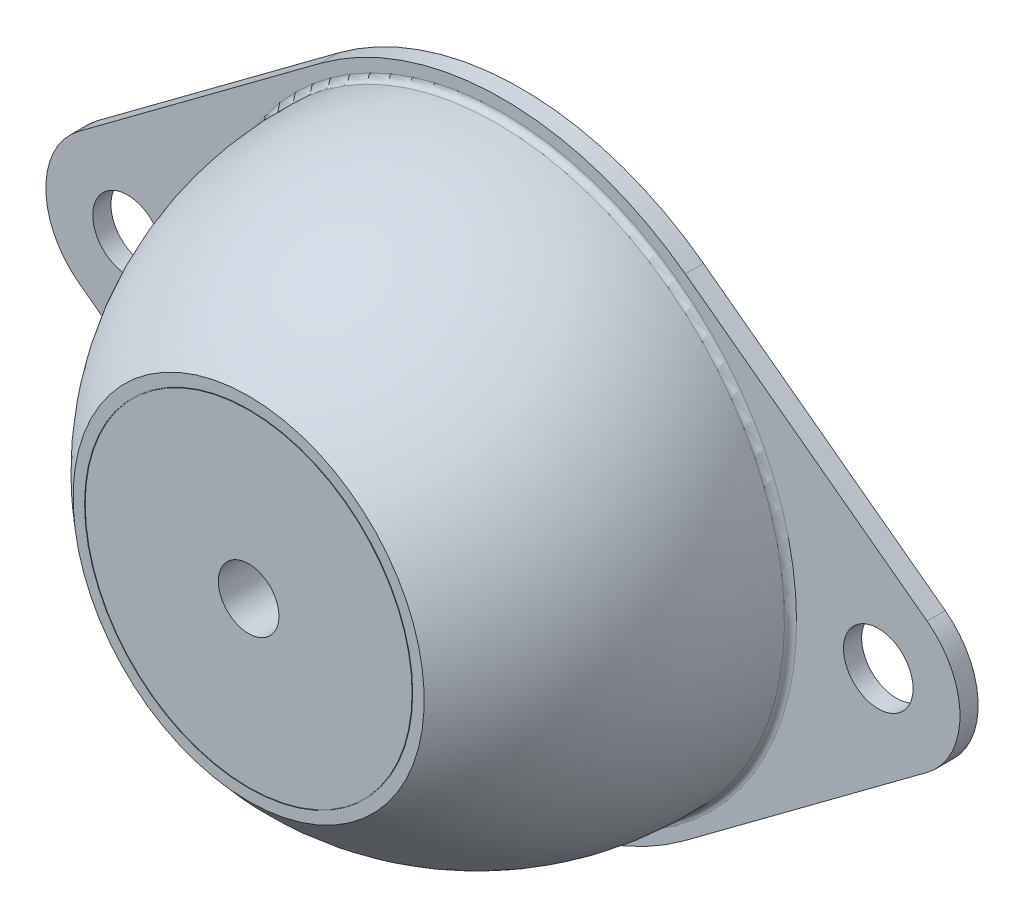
ISO-10303-21;
HEADER;
FILE_DESCRIPTION(('STEP AP214'),'2;1');
FILE_NAME('part.step','',(''),(''),'','','');
FILE_SCHEMA(('AUTOMOTIVE_DESIGN { 1 0 10303 214 1 1 1 1 }'));
ENDSEC;
DATA;
#1=APPLICATION_CONTEXT('core data for automotive mechanical design processes');
#2=APPLICATION_PROTOCOL_DEFINITION('international standard','automotive_design',2000,#1);
#3=PRODUCT_CONTEXT('',#1,'mechanical');
#4=PRODUCT('Part','Part','',(#3));
#5=PRODUCT_RELATED_PRODUCT_CATEGORY('part','',(#4));
#6=PRODUCT_DEFINITION_FORMATION('','',#4);
#7=PRODUCT_DEFINITION_CONTEXT('part definition',#1,'design');
#8=PRODUCT_DEFINITION('design','',#6,#7);
#9=PRODUCT_DEFINITION_SHAPE('','',#8);
#10=(LENGTH_UNIT() NAMED_UNIT(*) SI_UNIT(.MILLI.,.METRE.));
#11=(NAMED_UNIT(*) PLANE_ANGLE_UNIT() SI_UNIT($,.RADIAN.));
#12=(NAMED_UNIT(*) SI_UNIT($,.STERADIAN.) SOLID_ANGLE_UNIT());
#13=UNCERTAINTY_MEASURE_WITH_UNIT(LENGTH_MEASURE(1.E-05),#10,'distance_accuracy_value','');
#14=(GEOMETRIC_REPRESENTATION_CONTEXT(3) GLOBAL_UNCERTAINTY_ASSIGNED_CONTEXT((#13)) GLOBAL_UNIT_ASSIGNED_CONTEXT((#10,
#11,#12)) REPRESENTATION_CONTEXT('',''));
#15=CARTESIAN_POINT('',(0.,0.,0.));
#16=DIRECTION('',(0.,0.,1.));
#17=DIRECTION('',(1.,0.,0.));
#18=AXIS2_PLACEMENT_3D('',#15,#16,#17);
#19=CARTESIAN_POINT('',(0.,0.,3.));
#20=DIRECTION('',(0.,0.,1.));
#21=DIRECTION('',(0.,-1.,0.));
#22=AXIS2_PLACEMENT_3D('',#19,#20,#21);
#23=PLANE('',#22);
#24=DIRECTION('',(-0.802409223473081,-0.596774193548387,0.));
#25=VECTOR('',#24,1.);
#26=CARTESIAN_POINT('',(31.8629032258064,40.5216657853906,3.));
#27=LINE('',#26,#25);
#28=CARTESIAN_POINT('',(31.8629032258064,40.5216657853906,3.));
#29=VERTEX_POINT('',#28);
#30=CARTESIAN_POINT('',(-8.05645161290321,10.8325245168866,3.));
#31=VERTEX_POINT('',#30);
#32=EDGE_CURVE('E141',#29,#31,#27,.T.);
#33=ORIENTED_EDGE('',*,*,#32,.T.);
#34=CARTESIAN_POINT('',(0.,0.,3.));
#35=DIRECTION('',(0.,0.,1.));
#36=DIRECTION('',(1.,0.,0.));
#37=AXIS2_PLACEMENT_3D('',#34,#35,#36);
#38=CIRCLE('',#37,13.5);
#39=CARTESIAN_POINT('',(-8.05645161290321,-10.8325245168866,3.));
#40=VERTEX_POINT('',#39);
#41=EDGE_CURVE('E74',#31,#40,#38,.T.);
#42=ORIENTED_EDGE('',*,*,#41,.T.);
#43=DIRECTION('',(0.802409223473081,-0.596774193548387,0.));
#44=VECTOR('',#43,1.);
#45=CARTESIAN_POINT('',(-8.05645161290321,-10.8325245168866,3.));
#46=LINE('',#45,#44);
#47=CARTESIAN_POINT('',(31.8629032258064,-40.5216657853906,3.));
#48=VERTEX_POINT('',#47);
#49=EDGE_CURVE('E156',#40,#48,#46,.T.);
#50=ORIENTED_EDGE('',*,*,#49,.T.);
#51=CARTESIAN_POINT('',(62.,0.,3.));
#52=DIRECTION('',(0.,0.,1.));
#53=DIRECTION('',(1.,0.,0.));
#54=AXIS2_PLACEMENT_3D('',#51,#52,#53);
#55=CIRCLE('',#54,50.5);
#56=CARTESIAN_POINT('',(92.1370967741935,-40.5216657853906,3.));
#57=VERTEX_POINT('',#56);
#58=EDGE_CURVE('E169',#48,#57,#55,.T.);
#59=ORIENTED_EDGE('',*,*,#58,.T.);
#60=DIRECTION('',(0.802409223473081,0.596774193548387,0.));
#61=VECTOR('',#60,1.);
#62=CARTESIAN_POINT('',(92.1370967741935,-40.5216657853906,3.));
#63=LINE('',#62,#61);
#64=CARTESIAN_POINT('',(132.056451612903,-10.8325245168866,3.));
#65=VERTEX_POINT('',#64);
#66=EDGE_CURVE('E93',#57,#65,#63,.T.);
#67=ORIENTED_EDGE('',*,*,#66,.T.);
#68=CARTESIAN_POINT('',(124.,0.,3.));
#69=DIRECTION('',(0.,0.,1.));
#70=DIRECTION('',(1.,0.,0.));
#71=AXIS2_PLACEMENT_3D('',#68,#69,#70);
#72=CIRCLE('',#71,13.5);
#73=CARTESIAN_POINT('',(132.056451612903,10.8325245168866,3.));
#74=VERTEX_POINT('',#73);
#75=EDGE_CURVE('E87',#65,#74,#72,.T.);
#76=ORIENTED_EDGE('',*,*,#75,.T.);
#77=DIRECTION('',(-0.802409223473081,0.596774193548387,0.));
#78=VECTOR('',#77,1.);
#79=CARTESIAN_POINT('',(132.056451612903,10.8325245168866,3.));
#80=LINE('',#79,#78);
#81=CARTESIAN_POINT('',(92.1370967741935,40.5216657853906,3.));
#82=VERTEX_POINT('',#81);
#83=EDGE_CURVE('E91',#74,#82,#80,.T.);
#84=ORIENTED_EDGE('',*,*,#83,.T.);
#85=CARTESIAN_POINT('',(62.,0.,3.));
#86=DIRECTION('',(0.,0.,1.));
#87=DIRECTION('',(1.,0.,0.));
#88=AXIS2_PLACEMENT_3D('',#85,#86,#87);
#89=CIRCLE('',#88,50.5);
#90=EDGE_CURVE('E31',#82,#29,#89,.T.);
#91=ORIENTED_EDGE('',*,*,#90,.T.);
#92=EDGE_LOOP('',(#33,#42,#50,#59,#67,#76,#84,#91));
#93=FACE_BOUND('',#92,.T.);
#94=CARTESIAN_POINT('',(124.,0.,3.));
#95=DIRECTION('',(0.,0.,1.));
#96=DIRECTION('',(1.,0.,0.));
#97=AXIS2_PLACEMENT_3D('',#94,#95,#96);
#98=CIRCLE('',#97,5.75);
#99=CARTESIAN_POINT('',(129.75,0.,3.));
#100=VERTEX_POINT('',#99);
#101=EDGE_CURVE('E107',#100,#100,#98,.T.);
#102=ORIENTED_EDGE('',*,*,#101,.F.);
#103=EDGE_LOOP('',(#102));
#104=FACE_BOUND('',#103,.T.);
#105=CARTESIAN_POINT('',(0.,0.,3.));
#106=DIRECTION('',(0.,0.,1.));
#107=DIRECTION('',(1.,0.,0.));
#108=AXIS2_PLACEMENT_3D('',#105,#106,#107);
#109=CIRCLE('',#108,5.75);
#110=CARTESIAN_POINT('',(5.75,0.,3.));
#111=VERTEX_POINT('',#110);
#112=EDGE_CURVE('E113',#111,#111,#109,.T.);
#113=ORIENTED_EDGE('',*,*,#112,.F.);
#114=EDGE_LOOP('',(#113));
#115=FACE_BOUND('',#114,.T.);
#116=CARTESIAN_POINT('',(62.,0.,3.));
#117=DIRECTION('',(0.,0.,-1.));
#118=DIRECTION('',(0.,1.,0.));
#119=AXIS2_PLACEMENT_3D('',#116,#117,#118);
#120=CIRCLE('',#119,48.5);
#121=CARTESIAN_POINT('',(62.,48.5,3.));
#122=VERTEX_POINT('',#121);
#123=EDGE_CURVE('E192',#122,#122,#120,.T.);
#124=ORIENTED_EDGE('',*,*,#123,.T.);
#125=EDGE_LOOP('',(#124));
#126=FACE_BOUND('',#125,.T.);
#127=ADVANCED_FACE('F14',(#93,#104,#115,#126),#23,.T.);
#128=CARTESIAN_POINT('',(31.8629032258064,40.5216657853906,3.));
#129=DIRECTION('',(0.596774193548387,-0.802409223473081,0.));
#130=DIRECTION('',(0.802409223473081,0.596774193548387,0.));
#131=AXIS2_PLACEMENT_3D('',#128,#129,#130);
#132=PLANE('',#131);
#133=DIRECTION('',(-0.802409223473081,-0.596774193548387,0.));
#134=VECTOR('',#133,1.);
#135=CARTESIAN_POINT('',(31.8629032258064,40.5216657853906,0.));
#136=LINE('',#135,#134);
#137=CARTESIAN_POINT('',(31.8629032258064,40.5216657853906,0.));
#138=VERTEX_POINT('',#137);
#139=CARTESIAN_POINT('',(-8.05645161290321,10.8325245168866,0.));
#140=VERTEX_POINT('',#139);
#141=EDGE_CURVE('E117',#138,#140,#136,.T.);
#142=ORIENTED_EDGE('',*,*,#141,.T.);
#143=DIRECTION('',(0.,0.,-1.));
#144=VECTOR('',#143,1.);
#145=CARTESIAN_POINT('',(-8.05645161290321,10.8325245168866,3.));
#146=LINE('',#145,#144);
#147=EDGE_CURVE('E9',#31,#140,#146,.T.);
#148=ORIENTED_EDGE('',*,*,#147,.F.);
#149=ORIENTED_EDGE('',*,*,#32,.F.);
#150=DIRECTION('',(0.,0.,-1.));
#151=VECTOR('',#150,1.);
#152=CARTESIAN_POINT('',(31.8629032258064,40.5216657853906,3.));
#153=LINE('',#152,#151);
#154=EDGE_CURVE('E116',#29,#138,#153,.T.);
#155=ORIENTED_EDGE('',*,*,#154,.T.);
#156=EDGE_LOOP('',(#142,#148,#149,#155));
#157=FACE_BOUND('',#156,.T.);
#158=ADVANCED_FACE('F16',(#157),#132,.F.);
#159=CARTESIAN_POINT('',(0.,0.,3.));
#160=DIRECTION('',(0.,0.,-1.));
#161=DIRECTION('',(0.,1.,0.));
#162=AXIS2_PLACEMENT_3D('',#159,#160,#161);
#163=CYLINDRICAL_SURFACE('',#162,13.5);
#164=CARTESIAN_POINT('',(0.,0.,0.));
#165=DIRECTION('',(0.,0.,1.));
#166=DIRECTION('',(1.,0.,0.));
#167=AXIS2_PLACEMENT_3D('',#164,#165,#166);
#168=CIRCLE('',#167,13.5);
#169=CARTESIAN_POINT('',(-8.05645161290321,-10.8325245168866,0.));
#170=VERTEX_POINT('',#169);
#171=EDGE_CURVE('E120',#140,#170,#168,.T.);
#172=ORIENTED_EDGE('',*,*,#171,.T.);
#173=DIRECTION('',(0.,0.,-1.));
#174=VECTOR('',#173,1.);
#175=CARTESIAN_POINT('',(-8.05645161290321,-10.8325245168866,3.));
#176=LINE('',#175,#174);
#177=EDGE_CURVE('E23',#40,#170,#176,.T.);
#178=ORIENTED_EDGE('',*,*,#177,.F.);
#179=ORIENTED_EDGE('',*,*,#41,.F.);
#180=ORIENTED_EDGE('',*,*,#147,.T.);
#181=EDGE_LOOP('',(#172,#178,#179,#180));
#182=FACE_BOUND('',#181,.T.);
#183=ADVANCED_FACE('F236',(#182),#163,.T.);
#184=CARTESIAN_POINT('',(-8.05645161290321,-10.8325245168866,3.));
#185=DIRECTION('',(0.596774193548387,0.802409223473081,0.));
#186=DIRECTION('',(-0.802409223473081,0.596774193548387,0.));
#187=AXIS2_PLACEMENT_3D('',#184,#185,#186);
#188=PLANE('',#187);
#189=DIRECTION('',(0.802409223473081,-0.596774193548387,0.));
#190=VECTOR('',#189,1.);
#191=CARTESIAN_POINT('',(-8.05645161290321,-10.8325245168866,0.));
#192=LINE('',#191,#190);
#193=CARTESIAN_POINT('',(31.8629032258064,-40.5216657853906,0.));
#194=VERTEX_POINT('',#193);
#195=EDGE_CURVE('E123',#170,#194,#192,.T.);
#196=ORIENTED_EDGE('',*,*,#195,.T.);
#197=DIRECTION('',(0.,0.,-1.));
#198=VECTOR('',#197,1.);
#199=CARTESIAN_POINT('',(31.8629032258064,-40.5216657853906,3.));
#200=LINE('',#199,#198);
#201=EDGE_CURVE('E148',#48,#194,#200,.T.);
#202=ORIENTED_EDGE('',*,*,#201,.F.);
#203=ORIENTED_EDGE('',*,*,#49,.F.);
#204=ORIENTED_EDGE('',*,*,#177,.T.);
#205=EDGE_LOOP('',(#196,#202,#203,#204));
#206=FACE_BOUND('',#205,.T.);
#207=ADVANCED_FACE('F154',(#206),#188,.F.);
#208=CARTESIAN_POINT('',(62.,0.,3.));
#209=DIRECTION('',(0.,0.,-1.));
#210=DIRECTION('',(0.,1.,0.));
#211=AXIS2_PLACEMENT_3D('',#208,#209,#210);
#212=CYLINDRICAL_SURFACE('',#211,50.5);
#213=CARTESIAN_POINT('',(62.,0.,0.));
#214=DIRECTION('',(0.,0.,1.));
#215=DIRECTION('',(1.,0.,0.));
#216=AXIS2_PLACEMENT_3D('',#213,#214,#215);
#217=CIRCLE('',#216,50.5);
#218=CARTESIAN_POINT('',(92.1370967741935,-40.5216657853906,0.));
#219=VERTEX_POINT('',#218);
#220=EDGE_CURVE('E125',#194,#219,#217,.T.);
#221=ORIENTED_EDGE('',*,*,#220,.T.);
#222=DIRECTION('',(0.,0.,-1.));
#223=VECTOR('',#222,1.);
#224=CARTESIAN_POINT('',(92.1370967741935,-40.5216657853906,3.));
#225=LINE('',#224,#223);
#226=EDGE_CURVE('E145',#57,#219,#225,.T.);
#227=ORIENTED_EDGE('',*,*,#226,.F.);
#228=ORIENTED_EDGE('',*,*,#58,.F.);
#229=ORIENTED_EDGE('',*,*,#201,.T.);
#230=EDGE_LOOP('',(#221,#227,#228,#229));
#231=FACE_BOUND('',#230,.T.);
#232=ADVANCED_FACE('F165',(#231),#212,.T.);
#233=CARTESIAN_POINT('',(92.1370967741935,-40.5216657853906,3.));
#234=DIRECTION('',(-0.596774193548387,0.802409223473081,0.));
#235=DIRECTION('',(-0.802409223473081,-0.596774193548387,0.));
#236=AXIS2_PLACEMENT_3D('',#233,#234,#235);
#237=PLANE('',#236);
#238=DIRECTION('',(0.802409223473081,0.596774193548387,0.));
#239=VECTOR('',#238,1.);
#240=CARTESIAN_POINT('',(92.1370967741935,-40.5216657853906,0.));
#241=LINE('',#240,#239);
#242=CARTESIAN_POINT('',(132.056451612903,-10.8325245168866,0.));
#243=VERTEX_POINT('',#242);
#244=EDGE_CURVE('E127',#219,#243,#241,.T.);
#245=ORIENTED_EDGE('',*,*,#244,.T.);
#246=DIRECTION('',(0.,0.,-1.));
#247=VECTOR('',#246,1.);
#248=CARTESIAN_POINT('',(132.056451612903,-10.8325245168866,3.));
#249=LINE('',#248,#247);
#250=EDGE_CURVE('E102',#65,#243,#249,.T.);
#251=ORIENTED_EDGE('',*,*,#250,.F.);
#252=ORIENTED_EDGE('',*,*,#66,.F.);
#253=ORIENTED_EDGE('',*,*,#226,.T.);
#254=EDGE_LOOP('',(#245,#251,#252,#253));
#255=FACE_BOUND('',#254,.T.);
#256=ADVANCED_FACE('F168',(#255),#237,.F.);
#257=CARTESIAN_POINT('',(124.,0.,3.));
#258=DIRECTION('',(0.,0.,-1.));
#259=DIRECTION('',(0.,1.,0.));
#260=AXIS2_PLACEMENT_3D('',#257,#258,#259);
#261=CYLINDRICAL_SURFACE('',#260,13.5);
#262=CARTESIAN_POINT('',(124.,0.,0.));
#263=DIRECTION('',(0.,0.,1.));
#264=DIRECTION('',(1.,0.,0.));
#265=AXIS2_PLACEMENT_3D('',#262,#263,#264);
#266=CIRCLE('',#265,13.5);
#267=CARTESIAN_POINT('',(132.056451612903,10.8325245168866,0.));
#268=VERTEX_POINT('',#267);
#269=EDGE_CURVE('E101',#243,#268,#266,.T.);
#270=ORIENTED_EDGE('',*,*,#269,.T.);
#271=DIRECTION('',(0.,0.,-1.));
#272=VECTOR('',#271,1.);
#273=CARTESIAN_POINT('',(132.056451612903,10.8325245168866,3.));
#274=LINE('',#273,#272);
#275=EDGE_CURVE('E98',#74,#268,#274,.T.);
#276=ORIENTED_EDGE('',*,*,#275,.F.);
#277=ORIENTED_EDGE('',*,*,#75,.F.);
#278=ORIENTED_EDGE('',*,*,#250,.T.);
#279=EDGE_LOOP('',(#270,#276,#277,#278));
#280=FACE_BOUND('',#279,.T.);
#281=ADVANCED_FACE('F99',(#280),#261,.T.);
#282=CARTESIAN_POINT('',(132.056451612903,10.8325245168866,3.));
#283=DIRECTION('',(-0.596774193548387,-0.802409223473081,0.));
#284=DIRECTION('',(0.802409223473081,-0.596774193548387,0.));
#285=AXIS2_PLACEMENT_3D('',#282,#283,#284);
#286=PLANE('',#285);
#287=DIRECTION('',(-0.802409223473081,0.596774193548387,0.));
#288=VECTOR('',#287,1.);
#289=CARTESIAN_POINT('',(132.056451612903,10.8325245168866,0.));
#290=LINE('',#289,#288);
#291=CARTESIAN_POINT('',(92.1370967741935,40.5216657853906,0.));
#292=VERTEX_POINT('',#291);
#293=EDGE_CURVE('E60',#268,#292,#290,.T.);
#294=ORIENTED_EDGE('',*,*,#293,.T.);
#295=DIRECTION('',(0.,0.,-1.));
#296=VECTOR('',#295,1.);
#297=CARTESIAN_POINT('',(92.1370967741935,40.5216657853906,3.));
#298=LINE('',#297,#296);
#299=EDGE_CURVE('E103',#82,#292,#298,.T.);
#300=ORIENTED_EDGE('',*,*,#299,.F.);
#301=ORIENTED_EDGE('',*,*,#83,.F.);
#302=ORIENTED_EDGE('',*,*,#275,.T.);
#303=EDGE_LOOP('',(#294,#300,#301,#302));
#304=FACE_BOUND('',#303,.T.);
#305=ADVANCED_FACE('F105',(#304),#286,.F.);
#306=CARTESIAN_POINT('',(124.,0.,3.));
#307=DIRECTION('',(0.,0.,-1.));
#308=DIRECTION('',(0.,1.,0.));
#309=AXIS2_PLACEMENT_3D('',#306,#307,#308);
#310=CYLINDRICAL_SURFACE('',#309,5.75);
#311=ORIENTED_EDGE('',*,*,#101,.T.);
#312=EDGE_LOOP('',(#311));
#313=FACE_BOUND('',#312,.T.);
#314=CARTESIAN_POINT('',(124.,0.,0.));
#315=DIRECTION('',(0.,0.,1.));
#316=DIRECTION('',(1.,0.,0.));
#317=AXIS2_PLACEMENT_3D('',#314,#315,#316);
#318=CIRCLE('',#317,5.75);
#319=CARTESIAN_POINT('',(129.75,0.,0.));
#320=VERTEX_POINT('',#319);
#321=EDGE_CURVE('E132',#320,#320,#318,.T.);
#322=ORIENTED_EDGE('',*,*,#321,.F.);
#323=EDGE_LOOP('',(#322));
#324=FACE_BOUND('',#323,.T.);
#325=ADVANCED_FACE('F251',(#313,#324),#310,.F.);
#326=CARTESIAN_POINT('',(62.,0.,3.));
#327=DIRECTION('',(0.,0.,-1.));
#328=DIRECTION('',(0.,1.,0.));
#329=AXIS2_PLACEMENT_3D('',#326,#327,#328);
#330=CYLINDRICAL_SURFACE('',#329,29.);
#331=CARTESIAN_POINT('',(62.,0.,15.));
#332=DIRECTION('',(0.,0.,-1.));
#333=DIRECTION('',(0.,1.,0.));
#334=AXIS2_PLACEMENT_3D('',#331,#332,#333);
#335=CIRCLE('',#334,29.);
#336=CARTESIAN_POINT('',(62.,29.,15.));
#337=VERTEX_POINT('',#336);
#338=EDGE_CURVE('E195',#337,#337,#335,.T.);
#339=ORIENTED_EDGE('',*,*,#338,.F.);
#340=EDGE_LOOP('',(#339));
#341=FACE_BOUND('',#340,.T.);
#342=CARTESIAN_POINT('',(62.,0.,0.));
#343=DIRECTION('',(0.,0.,1.));
#344=DIRECTION('',(1.,0.,0.));
#345=AXIS2_PLACEMENT_3D('',#342,#343,#344);
#346=CIRCLE('',#345,29.);
#347=CARTESIAN_POINT('',(91.,0.,0.));
#348=VERTEX_POINT('',#347);
#349=EDGE_CURVE('E135',#348,#348,#346,.T.);
#350=ORIENTED_EDGE('',*,*,#349,.F.);
#351=EDGE_LOOP('',(#350));
#352=FACE_BOUND('',#351,.T.);
#353=ADVANCED_FACE('F247',(#341,#352),#330,.F.);
#354=CARTESIAN_POINT('',(0.,0.,3.));
#355=DIRECTION('',(0.,0.,-1.));
#356=DIRECTION('',(0.,1.,0.));
#357=AXIS2_PLACEMENT_3D('',#354,#355,#356);
#358=CYLINDRICAL_SURFACE('',#357,5.75);
#359=ORIENTED_EDGE('',*,*,#112,.T.);
#360=EDGE_LOOP('',(#359));
#361=FACE_BOUND('',#360,.T.);
#362=CARTESIAN_POINT('',(0.,0.,0.));
#363=DIRECTION('',(0.,0.,1.));
#364=DIRECTION('',(1.,0.,0.));
#365=AXIS2_PLACEMENT_3D('',#362,#363,#364);
#366=CIRCLE('',#365,5.75);
#367=CARTESIAN_POINT('',(5.75,0.,0.));
#368=VERTEX_POINT('',#367);
#369=EDGE_CURVE('E138',#368,#368,#366,.T.);
#370=ORIENTED_EDGE('',*,*,#369,.F.);
#371=EDGE_LOOP('',(#370));
#372=FACE_BOUND('',#371,.T.);
#373=ADVANCED_FACE('F244',(#361,#372),#358,.F.);
#374=CARTESIAN_POINT('',(62.,0.,3.));
#375=DIRECTION('',(0.,0.,-1.));
#376=DIRECTION('',(0.,1.,0.));
#377=AXIS2_PLACEMENT_3D('',#374,#375,#376);
#378=CYLINDRICAL_SURFACE('',#377,50.5);
#379=CARTESIAN_POINT('',(62.,0.,0.));
#380=DIRECTION('',(0.,0.,1.));
#381=DIRECTION('',(1.,0.,0.));
#382=AXIS2_PLACEMENT_3D('',#379,#380,#381);
#383=CIRCLE('',#382,50.5);
#384=EDGE_CURVE('E66',#292,#138,#383,.T.);
#385=ORIENTED_EDGE('',*,*,#384,.T.);
#386=ORIENTED_EDGE('',*,*,#154,.F.);
#387=ORIENTED_EDGE('',*,*,#90,.F.);
#388=ORIENTED_EDGE('',*,*,#299,.T.);
#389=EDGE_LOOP('',(#385,#386,#387,#388));
#390=FACE_BOUND('',#389,.T.);
#391=ADVANCED_FACE('F242',(#390),#378,.T.);
#392=CARTESIAN_POINT('',(0.,0.,0.));
#393=DIRECTION('',(0.,0.,1.));
#394=DIRECTION('',(0.,-1.,0.));
#395=AXIS2_PLACEMENT_3D('',#392,#393,#394);
#396=PLANE('',#395);
#397=ORIENTED_EDGE('',*,*,#349,.T.);
#398=EDGE_LOOP('',(#397));
#399=FACE_BOUND('',#398,.T.);
#400=ORIENTED_EDGE('',*,*,#141,.F.);
#401=ORIENTED_EDGE('',*,*,#384,.F.);
#402=ORIENTED_EDGE('',*,*,#293,.F.);
#403=ORIENTED_EDGE('',*,*,#269,.F.);
#404=ORIENTED_EDGE('',*,*,#244,.F.);
#405=ORIENTED_EDGE('',*,*,#220,.F.);
#406=ORIENTED_EDGE('',*,*,#195,.F.);
#407=ORIENTED_EDGE('',*,*,#171,.F.);
#408=EDGE_LOOP('',(#400,#401,#402,#403,#404,#405,#406,#407));
#409=FACE_BOUND('',#408,.T.);
#410=ORIENTED_EDGE('',*,*,#321,.T.);
#411=EDGE_LOOP('',(#410));
#412=FACE_BOUND('',#411,.T.);
#413=ORIENTED_EDGE('',*,*,#369,.T.);
#414=EDGE_LOOP('',(#413));
#415=FACE_BOUND('',#414,.T.);
#416=ADVANCED_FACE('F160',(#399,#409,#412,#415),#396,.F.);
#417=CARTESIAN_POINT('',(72.,0.,34.));
#418=DIRECTION('',(0.,0.,1.));
#419=DIRECTION('',(0.,-1.,0.));
#420=AXIS2_PLACEMENT_3D('',#417,#418,#419);
#421=PLANE('',#420);
#422=CARTESIAN_POINT('',(62.,0.,34.));
#423=DIRECTION('',(0.,0.,-1.));
#424=DIRECTION('',(0.,1.,0.));
#425=AXIS2_PLACEMENT_3D('',#422,#423,#424);
#426=CIRCLE('',#425,5.);
#427=CARTESIAN_POINT('',(62.,5.,34.));
#428=VERTEX_POINT('',#427);
#429=EDGE_CURVE('E204',#428,#428,#426,.T.);
#430=ORIENTED_EDGE('',*,*,#429,.F.);
#431=EDGE_LOOP('',(#430));
#432=FACE_BOUND('',#431,.T.);
#433=CARTESIAN_POINT('',(62.,0.,34.));
#434=DIRECTION('',(0.,0.,-1.));
#435=DIRECTION('',(0.,1.,0.));
#436=AXIS2_PLACEMENT_3D('',#433,#434,#435);
#437=CIRCLE('',#436,10.);
#438=CARTESIAN_POINT('',(62.,10.,34.));
#439=VERTEX_POINT('',#438);
#440=EDGE_CURVE('E201',#439,#439,#437,.T.);
#441=ORIENTED_EDGE('',*,*,#440,.T.);
#442=EDGE_LOOP('',(#441));
#443=FACE_BOUND('',#442,.T.);
#444=ADVANCED_FACE('F241',(#432,#443),#421,.F.);
#445=CARTESIAN_POINT('',(62.,0.,34.));
#446=DIRECTION('',(0.,0.,-1.));
#447=DIRECTION('',(0.,1.,0.));
#448=AXIS2_PLACEMENT_3D('',#445,#446,#447);
#449=TOROIDAL_SURFACE('',#448,11.,1.00000000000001);
#450=CARTESIAN_POINT('',(62.,0.,33.));
#451=DIRECTION('',(0.,0.,-1.));
#452=DIRECTION('',(0.,1.,0.));
#453=AXIS2_PLACEMENT_3D('',#450,#451,#452);
#454=CIRCLE('',#453,11.);
#455=CARTESIAN_POINT('',(62.,11.,33.));
#456=VERTEX_POINT('',#455);
#457=EDGE_CURVE('E198',#456,#456,#454,.T.);
#458=ORIENTED_EDGE('',*,*,#457,.T.);
#459=EDGE_LOOP('',(#458));
#460=FACE_BOUND('',#459,.T.);
#461=ORIENTED_EDGE('',*,*,#440,.F.);
#462=EDGE_LOOP('',(#461));
#463=FACE_BOUND('',#462,.T.);
#464=ADVANCED_FACE('F227',(#460,#463),#449,.T.);
#465=CARTESIAN_POINT('',(62.,0.,15.));
#466=DIRECTION('',(0.,0.,-1.));
#467=DIRECTION('',(0.,1.,0.));
#468=AXIS2_PLACEMENT_3D('',#465,#466,#467);
#469=DEGENERATE_TOROIDAL_SURFACE('',#468,11.,18.,.T.);
#470=ORIENTED_EDGE('',*,*,#457,.F.);
#471=EDGE_LOOP('',(#470));
#472=FACE_BOUND('',#471,.T.);
#473=ORIENTED_EDGE('',*,*,#338,.T.);
#474=EDGE_LOOP('',(#473));
#475=FACE_BOUND('',#474,.T.);
#476=ADVANCED_FACE('F216',(#472,#475),#469,.F.);
#477=CARTESIAN_POINT('',(62.,0.,45.));
#478=DIRECTION('',(0.,0.,-1.));
#479=DIRECTION('',(0.,1.,0.));
#480=AXIS2_PLACEMENT_3D('',#477,#478,#479);
#481=PLANE('',#480);
#482=CARTESIAN_POINT('',(62.,0.,45.));
#483=DIRECTION('',(0.,0.,-1.));
#484=DIRECTION('',(0.,1.,0.));
#485=AXIS2_PLACEMENT_3D('',#482,#483,#484);
#486=CIRCLE('',#485,27.);
#487=CARTESIAN_POINT('',(62.,27.,45.));
#488=VERTEX_POINT('',#487);
#489=EDGE_CURVE('E121',#488,#488,#486,.T.);
#490=ORIENTED_EDGE('',*,*,#489,.F.);
#491=EDGE_LOOP('',(#490));
#492=FACE_BOUND('',#491,.T.);
#493=CARTESIAN_POINT('',(62.,0.,45.));
#494=DIRECTION('',(0.,0.,1.));
#495=DIRECTION('',(0.,-1.,0.));
#496=AXIS2_PLACEMENT_3D('',#493,#494,#495);
#497=CIRCLE('',#496,5.);
#498=CARTESIAN_POINT('',(62.,-5.,45.));
#499=VERTEX_POINT('',#498);
#500=EDGE_CURVE('E207',#499,#499,#497,.T.);
#501=ORIENTED_EDGE('',*,*,#500,.F.);
#502=EDGE_LOOP('',(#501));
#503=FACE_BOUND('',#502,.T.);
#504=ADVANCED_FACE('F213',(#492,#503),#481,.F.);
#505=CARTESIAN_POINT('',(62.,0.,34.));
#506=DIRECTION('',(0.,0.,-1.));
#507=DIRECTION('',(0.,1.,0.));
#508=AXIS2_PLACEMENT_3D('',#505,#506,#507);
#509=CYLINDRICAL_SURFACE('',#508,27.);
#510=CARTESIAN_POINT('',(62.,0.,44.9));
#511=DIRECTION('',(0.,0.,-1.));
#512=DIRECTION('',(0.,1.,0.));
#513=AXIS2_PLACEMENT_3D('',#510,#511,#512);
#514=CIRCLE('',#513,27.);
#515=CARTESIAN_POINT('',(62.,27.,44.9));
#516=VERTEX_POINT('',#515);
#517=EDGE_CURVE('E177',#516,#516,#514,.T.);
#518=ORIENTED_EDGE('',*,*,#517,.F.);
#519=EDGE_LOOP('',(#518));
#520=FACE_BOUND('',#519,.T.);
#521=ORIENTED_EDGE('',*,*,#489,.T.);
#522=EDGE_LOOP('',(#521));
#523=FACE_BOUND('',#522,.T.);
#524=ADVANCED_FACE('F215',(#520,#523),#509,.T.);
#525=CARTESIAN_POINT('',(89.,0.,44.9));
#526=DIRECTION('',(0.,0.,-1.));
#527=DIRECTION('',(0.,1.,0.));
#528=AXIS2_PLACEMENT_3D('',#525,#526,#527);
#529=PLANE('',#528);
#530=CARTESIAN_POINT('',(62.,0.,44.9));
#531=DIRECTION('',(0.,0.,-1.));
#532=DIRECTION('',(0.,1.,0.));
#533=AXIS2_PLACEMENT_3D('',#530,#531,#532);
#534=CIRCLE('',#533,27.1);
#535=CARTESIAN_POINT('',(62.,27.1,44.9));
#536=VERTEX_POINT('',#535);
#537=EDGE_CURVE('E180',#536,#536,#534,.T.);
#538=ORIENTED_EDGE('',*,*,#537,.F.);
#539=EDGE_LOOP('',(#538));
#540=FACE_BOUND('',#539,.T.);
#541=ORIENTED_EDGE('',*,*,#517,.T.);
#542=EDGE_LOOP('',(#541));
#543=FACE_BOUND('',#542,.T.);
#544=ADVANCED_FACE('F224',(#540,#543),#529,.F.);
#545=CARTESIAN_POINT('',(62.,0.,34.));
#546=DIRECTION('',(0.,0.,-1.));
#547=DIRECTION('',(0.,1.,0.));
#548=AXIS2_PLACEMENT_3D('',#545,#546,#547);
#549=CYLINDRICAL_SURFACE('',#548,27.1);
#550=CARTESIAN_POINT('',(62.,0.,45.));
#551=DIRECTION('',(0.,0.,-1.));
#552=DIRECTION('',(0.,1.,0.));
#553=AXIS2_PLACEMENT_3D('',#550,#551,#552);
#554=CIRCLE('',#553,27.1);
#555=CARTESIAN_POINT('',(62.,27.1,45.));
#556=VERTEX_POINT('',#555);
#557=EDGE_CURVE('E183',#556,#556,#554,.T.);
#558=ORIENTED_EDGE('',*,*,#557,.F.);
#559=EDGE_LOOP('',(#558));
#560=FACE_BOUND('',#559,.T.);
#561=ORIENTED_EDGE('',*,*,#537,.T.);
#562=EDGE_LOOP('',(#561));
#563=FACE_BOUND('',#562,.T.);
#564=ADVANCED_FACE('F356',(#560,#563),#549,.F.);
#565=CARTESIAN_POINT('',(89.1,0.,45.));
#566=DIRECTION('',(0.,0.,-1.));
#567=DIRECTION('',(0.,1.,0.));
#568=AXIS2_PLACEMENT_3D('',#565,#566,#567);
#569=PLANE('',#568);
#570=CARTESIAN_POINT('',(62.,0.,45.));
#571=DIRECTION('',(0.,0.,-1.));
#572=DIRECTION('',(0.,1.,0.));
#573=AXIS2_PLACEMENT_3D('',#570,#571,#572);
#574=CIRCLE('',#573,29.);
#575=CARTESIAN_POINT('',(62.,29.,45.));
#576=VERTEX_POINT('',#575);
#577=EDGE_CURVE('E186',#576,#576,#574,.T.);
#578=ORIENTED_EDGE('',*,*,#577,.F.);
#579=EDGE_LOOP('',(#578));
#580=FACE_BOUND('',#579,.T.);
#581=ORIENTED_EDGE('',*,*,#557,.T.);
#582=EDGE_LOOP('',(#581));
#583=FACE_BOUND('',#582,.T.);
#584=ADVANCED_FACE('F366',(#580,#583),#569,.F.);
#585=CARTESIAN_POINT('',(62.,0.,5.90338615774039));
#586=DIRECTION('',(0.,0.,-1.));
#587=DIRECTION('',(0.,1.,0.));
#588=AXIS2_PLACEMENT_3D('',#585,#586,#587);
#589=DEGENERATE_TOROIDAL_SURFACE('',#588,2.9641171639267,50.5,.F.);
#590=ORIENTED_EDGE('',*,*,#577,.T.);
#591=EDGE_LOOP('',(#590));
#592=FACE_BOUND('',#591,.T.);
#593=CARTESIAN_POINT('',(62.,0.,3.99999999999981));
#594=DIRECTION('',(0.,0.,-1.));
#595=DIRECTION('',(0.,1.,0.));
#596=AXIS2_PLACEMENT_3D('',#593,#594,#595);
#597=CIRCLE('',#596,47.5);
#598=CARTESIAN_POINT('',(62.,47.5,3.99999999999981));
#599=VERTEX_POINT('',#598);
#600=EDGE_CURVE('E189',#599,#599,#597,.T.);
#601=ORIENTED_EDGE('',*,*,#600,.F.);
#602=EDGE_LOOP('',(#601));
#603=FACE_BOUND('',#602,.T.);
#604=ADVANCED_FACE('F377',(#592,#603),#589,.F.);
#605=CARTESIAN_POINT('',(62.,0.,4.));
#606=DIRECTION('',(0.,0.,-1.));
#607=DIRECTION('',(0.,1.,0.));
#608=AXIS2_PLACEMENT_3D('',#605,#606,#607);
#609=TOROIDAL_SURFACE('',#608,48.5,1.00000000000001);
#610=ORIENTED_EDGE('',*,*,#123,.F.);
#611=EDGE_LOOP('',(#610));
#612=FACE_BOUND('',#611,.T.);
#613=ORIENTED_EDGE('',*,*,#600,.T.);
#614=EDGE_LOOP('',(#613));
#615=FACE_BOUND('',#614,.T.);
#616=ADVANCED_FACE('F388',(#612,#615),#609,.F.);
#617=CARTESIAN_POINT('',(62.,0.,0.));
#618=DIRECTION('',(0.,0.,1.));
#619=DIRECTION('',(0.,-1.,0.));
#620=AXIS2_PLACEMENT_3D('',#617,#618,#619);
#621=CYLINDRICAL_SURFACE('',#620,5.);
#622=ORIENTED_EDGE('',*,*,#429,.T.);
#623=EDGE_LOOP('',(#622));
#624=FACE_BOUND('',#623,.T.);
#625=ORIENTED_EDGE('',*,*,#500,.T.);
#626=EDGE_LOOP('',(#625));
#627=FACE_BOUND('',#626,.T.);
#628=ADVANCED_FACE('F211',(#624,#627),#621,.F.);
#629=CLOSED_SHELL('',(#127,#158,#183,#207,#232,#256,#281,#305,#325,#353,#373,#391,#416,#444,
#464,#476,#504,#524,#544,#564,#584,#604,#616,#628));
#630=MANIFOLD_SOLID_BREP('B1',#629);
#631=ADVANCED_BREP_SHAPE_REPRESENTATION('',(#18,#630),#14);
#632=SHAPE_DEFINITION_REPRESENTATION(#9,#631);
ENDSEC;
END-ISO-10303-21;
